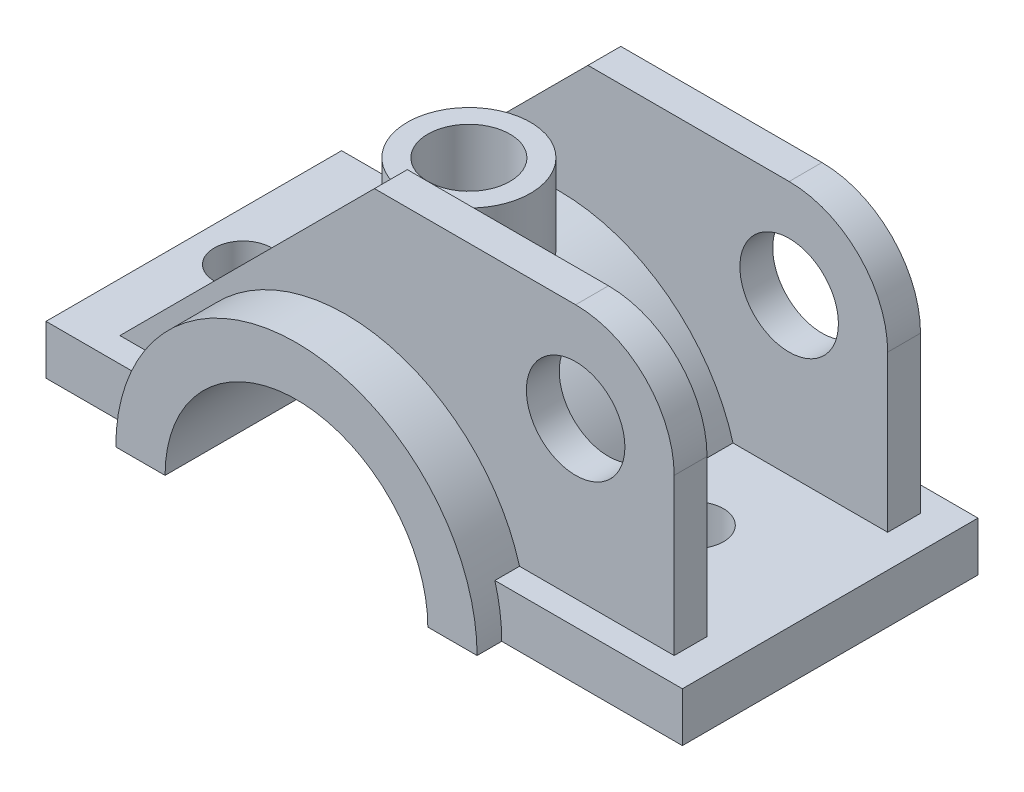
from build123d import *

# Parameters (mm, degrees)
EXTRUDE_1_DEPTH      = 42
EXTRUDE_2_REACH      = 128.574
EXTRUDE_2_END_RADIUS = 44
SKETCH_2_W           = 72
SKETCH_2_H           = 12
EXTRUDE_3_REACH      = 168.508
EXTRUDE_3_END_RADIUS = 44
SKETCH_3_W           = 72
SKETCH_3_H           = 12
EXTRUDE_4_REACH      = 117.551
EXTRUDE_4_END_RADIUS = 44
SKETCH_4_R           = 15
SKETCH_4_R_2         = 10
SKETCH_6_R           = 12
EXTRUDE_6_DEPTH      = 8
SKETCH_7_R           = 7
CUT_EXTRUDE_1_DEPTH  = 116.550854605
SKETCH_8_R           = 10
CUT_EXTRUDE_2_DEPTH  = 116.550854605


with BuildPart() as part:
    # Sketch 1 → Extrude 1 (new, symmetric)
    with BuildSketch(Plane.XY):
        with BuildLine():
            Line((-44, 0), (-32, 0))
            ThreePointArc((-32, 0), (0, 32), (32, 0))
            Line((32, 0), (44, 0))
            ThreePointArc((44, 0), (0, 44), (-44, 0))
        make_face()
    extrude(amount=EXTRUDE_1_DEPTH, both=True)

    # Extrude 2: up to this cylinder (the profile starts outside it)
    extrude_2_end = Plane(origin=(0, 0, 0), z_dir=(0, 0, 1)) * Cylinder(EXTRUDE_2_END_RADIUS, 346.148, mode=Mode.PRIVATE)
    # Sketch 2 → Extrude 2 (add, up to the surface)
    with BuildSketch(Plane(origin=(-67, 0, 0), x_dir=(0, 0, -1), z_dir=(1, 0, 0)), mode=Mode.PRIVATE) as extrude_2_sk1:
        with Locations((0, 6)):
            Rectangle(SKETCH_2_W, SKETCH_2_H)
    extrude_2_tool1 = extrude(extrude_2_sk1.sketch, amount=EXTRUDE_2_REACH, mode=Mode.PRIVATE) - extrude_2_end
    add(extrude_2_tool1.solids().sort_by_distance((-67, 6, 0))[0])

    # Extrude 3: up to this cylinder (the profile starts outside it)
    extrude_3_end = Plane(origin=(0, 0, 0), z_dir=(0, 0, 1)) * Cylinder(EXTRUDE_3_END_RADIUS, 426.016, mode=Mode.PRIVATE)
    # Sketch 3 → Extrude 3 (add, up to the surface)
    with BuildSketch(Plane(origin=(88, 0, 0), x_dir=(0, 0, -1), z_dir=(1, 0, 0)), mode=Mode.PRIVATE) as extrude_3_sk1:
        with Locations((0, 6)):
            Rectangle(SKETCH_3_W, SKETCH_3_H)
    extrude_3_tool1 = extrude(extrude_3_sk1.sketch, amount=-EXTRUDE_3_REACH, mode=Mode.PRIVATE) - extrude_3_end
    add(extrude_3_tool1.solids().sort_by_distance((88, 6, 0))[0])

    # Extrude 4: up to this cylinder (the profile starts outside it)
    extrude_4_end = Plane(origin=(0, 0, -14.575736), z_dir=(0, 0, 1)) * Cylinder(EXTRUDE_4_END_RADIUS, 324.102, mode=Mode.PRIVATE)
    # Sketch 4 → Extrude 4 (add, up to the surface)
    with BuildSketch(Plane(origin=(0, 62, 0), x_dir=(-1, 0, 0), z_dir=(0, 1, 0)), mode=Mode.PRIVATE) as extrude_4_sk1:
        with Locations(Location((0, 0, 0), (0, 0, 90))):
            Circle(SKETCH_4_R)
        with Locations(Location((0, 0, 0), (0, 0, 90))):
            Circle(SKETCH_4_R_2, mode=Mode.SUBTRACT)
    extrude_4_tool1 = extrude(extrude_4_sk1.sketch, amount=-EXTRUDE_4_REACH, mode=Mode.PRIVATE) - extrude_4_end
    add(extrude_4_tool1.solids().sort_by_distance((0, 62, -14.575736))[0])

    # Sketch 6 → Extrude 6 (add)
    with BuildSketch(Plane.XY.offset(30)):
        with BuildLine():
            Line((80, 12), (80, 50))
            ThreePointArc((80, 50), (72.970562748, 66.970562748), (56, 74))
            Line((56, 74), (7, 74))
            Line((7, 74), (-55, 12))
            Line((-55, 12), (-42.332020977, 12))
            ThreePointArc((-42.332020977, 12), (0, 44), (42.332020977, 12))
            Line((42.332020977, 12), (80, 12))
        make_face()
        with Locations((56, 50)):
            Circle(SKETCH_6_R, mode=Mode.SUBTRACT)
    extrude_6 = extrude(amount=-EXTRUDE_6_DEPTH)

    # Mirror 2: Extrude 6 across plane
    add(extrude_6.mirror(Plane.XY))

    # Sketch 7 → Cut-Extrude 1 (cut, through all)
    with BuildSketch(Plane(origin=(0, 12, 0), x_dir=(1, 0, 0), z_dir=(0, 1, 0))):
        with Locations(Location((-55, 0, 0), (0, 0, 270))):
            Circle(SKETCH_7_R)
        with Locations(Location((55, 0, 0), (0, 0, 270))):
            Circle(SKETCH_7_R)
    extrude(amount=-CUT_EXTRUDE_1_DEPTH, mode=Mode.SUBTRACT)

    # Sketch 8 → Cut-Extrude 2 (cut, through all)
    with BuildSketch(Plane(origin=(0, 62, 0), x_dir=(1, 0, 0), z_dir=(0, 1, 0))):
        with Locations(Location((0, 0, 0), (0, 0, 270))):
            Circle(SKETCH_8_R)
    extrude(amount=-CUT_EXTRUDE_2_DEPTH, mode=Mode.SUBTRACT)


solid = part.part
